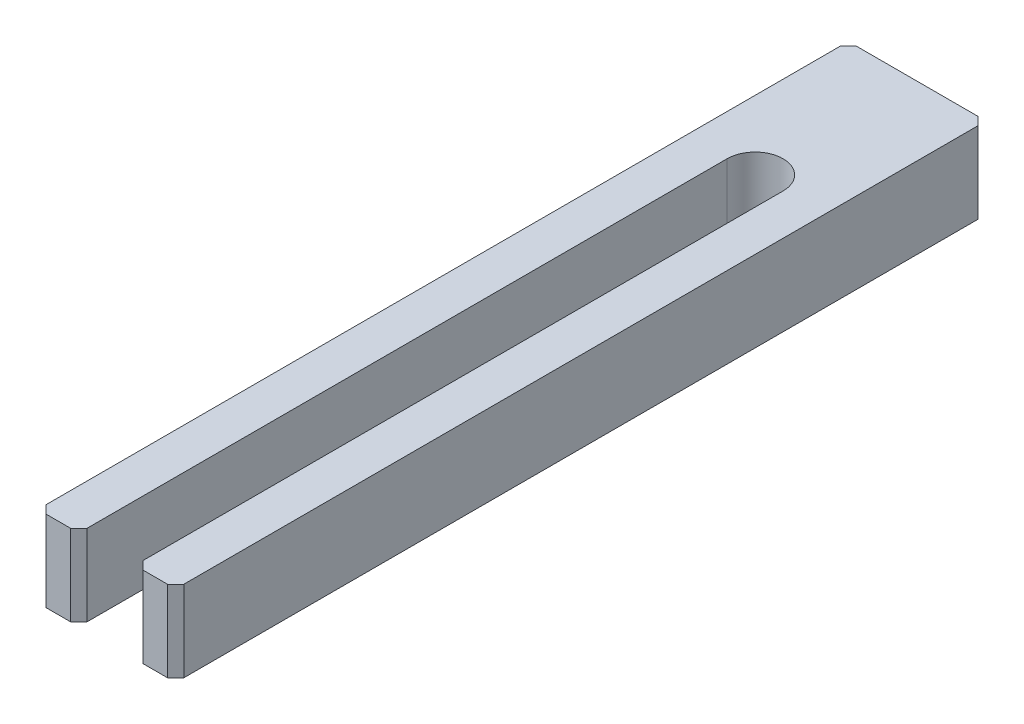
from build123d import *

# Parameters (mm, degrees)
ESQUISSE1_W             = 34
ESQUISSE1_H             = 200
BOSS_EXTRU_1_DEPTH      = 20
ESQUISSE2_R             = 6.9
ENL_V_MAT_EXTRU_1_DEPTH = 104.387620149
ESQUISSE3_W             = 13.8
ESQUISSE3_H             = 160
ENL_V_MAT_EXTRU_2_DEPTH = 104.387620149
CHANFREIN1_SIZE         = 2


with BuildPart() as part:
    # Esquisse1 → Boss.-Extru.1 (new body)
    with BuildSketch(Plane(origin=(0, 0, 0), x_dir=(1, 0, 0), z_dir=(0, 1, 0))):
        Rectangle(ESQUISSE1_W, ESQUISSE1_H)
    extrude(amount=BOSS_EXTRU_1_DEPTH)

    # Esquisse2 → Enl_v. mat.-Extru.1 (cut, through all)
    with BuildSketch(Plane(origin=(0, 20, 0), x_dir=(1, 0, 0), z_dir=(0, 1, 0))):
        with Locations(Location((0, 60, 0), (0, 0, 270))):
            Circle(ESQUISSE2_R)
    extrude(amount=-ENL_V_MAT_EXTRU_1_DEPTH, mode=Mode.SUBTRACT)

    # Esquisse3 → Enl_v. mat.-Extru.2 (cut, through all)
    with BuildSketch(Plane(origin=(0, 20, 0), x_dir=(1, 0, 0), z_dir=(0, 1, 0))):
        with Locations((0, -20)):
            Rectangle(ESQUISSE3_W, ESQUISSE3_H)
    extrude(amount=-ENL_V_MAT_EXTRU_2_DEPTH, mode=Mode.SUBTRACT)

    # Chanfrein1
    chanfrein1_edges = [part.edges().sort_by_distance(p)[0] for p in [
        (-6.9, 10, 100),
        (6.9, 10, 100),
        (-17, 10, -100),
        (17, 10, -100),
        (17, 10, 100),
        (-17, 10, 100),
    ]]
    chamfer(chanfrein1_edges, length=CHANFREIN1_SIZE)


solid = part.part
